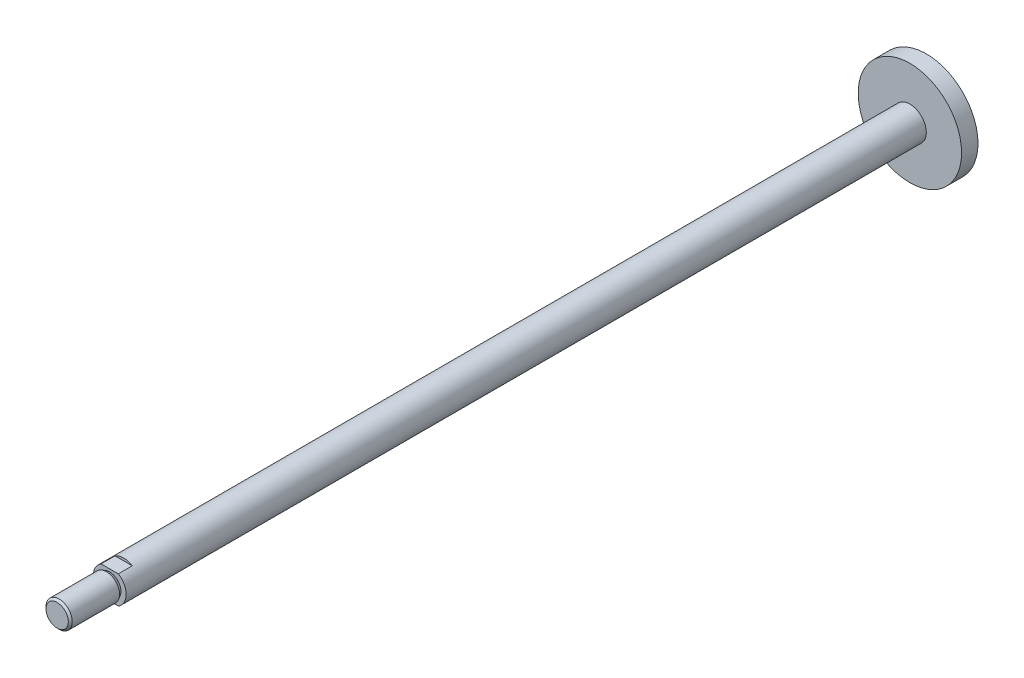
ISO-10303-21;
HEADER;
FILE_DESCRIPTION(('STEP AP214'),'2;1');
FILE_NAME('part.step','',(''),(''),'','','');
FILE_SCHEMA(('AUTOMOTIVE_DESIGN { 1 0 10303 214 1 1 1 1 }'));
ENDSEC;
DATA;
#1=APPLICATION_CONTEXT('core data for automotive mechanical design processes');
#2=APPLICATION_PROTOCOL_DEFINITION('international standard','automotive_design',2000,#1);
#3=PRODUCT_CONTEXT('',#1,'mechanical');
#4=PRODUCT('Part','Part','',(#3));
#5=PRODUCT_RELATED_PRODUCT_CATEGORY('part','',(#4));
#6=PRODUCT_DEFINITION_FORMATION('','',#4);
#7=PRODUCT_DEFINITION_CONTEXT('part definition',#1,'design');
#8=PRODUCT_DEFINITION('design','',#6,#7);
#9=PRODUCT_DEFINITION_SHAPE('','',#8);
#10=(LENGTH_UNIT() NAMED_UNIT(*) SI_UNIT(.MILLI.,.METRE.));
#11=(NAMED_UNIT(*) PLANE_ANGLE_UNIT() SI_UNIT($,.RADIAN.));
#12=(NAMED_UNIT(*) SI_UNIT($,.STERADIAN.) SOLID_ANGLE_UNIT());
#13=UNCERTAINTY_MEASURE_WITH_UNIT(LENGTH_MEASURE(1.E-05),#10,'distance_accuracy_value','');
#14=(GEOMETRIC_REPRESENTATION_CONTEXT(3) GLOBAL_UNCERTAINTY_ASSIGNED_CONTEXT((#13)) GLOBAL_UNIT_ASSIGNED_CONTEXT((#10,
#11,#12)) REPRESENTATION_CONTEXT('',''));
#15=CARTESIAN_POINT('',(0.,0.,0.));
#16=DIRECTION('',(0.,0.,1.));
#17=DIRECTION('',(1.,0.,0.));
#18=AXIS2_PLACEMENT_3D('',#15,#16,#17);
#19=CARTESIAN_POINT('',(0.,3.39999999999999,68.9999999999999));
#20=DIRECTION('',(0.,0.,1.));
#21=DIRECTION('',(1.,0.,0.));
#22=AXIS2_PLACEMENT_3D('',#19,#20,#21);
#23=PLANE('',#22);
#24=CARTESIAN_POINT('',(1.11022302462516E-13,0.,68.9999999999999));
#25=DIRECTION('',(0.,0.,-1.));
#26=DIRECTION('',(-1.,0.,0.));
#27=AXIS2_PLACEMENT_3D('',#24,#25,#26);
#28=CIRCLE('',#27,6.79999999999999);
#29=CARTESIAN_POINT('',(-6.79999999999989,0.,68.9999999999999));
#30=VERTEX_POINT('',#29);
#31=EDGE_CURVE('E20',#30,#30,#28,.T.);
#32=ORIENTED_EDGE('',*,*,#31,.F.);
#33=EDGE_LOOP('',(#32));
#34=FACE_BOUND('',#33,.T.);
#35=ADVANCED_FACE('F16',(#34),#23,.T.);
#36=CARTESIAN_POINT('',(1.11022302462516E-13,0.,67.7999999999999));
#37=DIRECTION('',(0.,0.,-1.));
#38=DIRECTION('',(-1.,0.,0.));
#39=AXIS2_PLACEMENT_3D('',#36,#37,#38);
#40=CONICAL_SURFACE('',#39,7.99999999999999,0.78539816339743);
#41=ORIENTED_EDGE('',*,*,#31,.T.);
#42=EDGE_LOOP('',(#41));
#43=FACE_BOUND('',#42,.T.);
#44=CARTESIAN_POINT('',(1.11022302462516E-13,0.,67.7999999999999));
#45=DIRECTION('',(0.,0.,1.));
#46=DIRECTION('',(1.,0.,0.));
#47=AXIS2_PLACEMENT_3D('',#44,#45,#46);
#48=CIRCLE('',#47,8.);
#49=CARTESIAN_POINT('',(8.00000000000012,0.,67.7999999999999));
#50=VERTEX_POINT('',#49);
#51=EDGE_CURVE('E108',#50,#50,#48,.F.);
#52=ORIENTED_EDGE('',*,*,#51,.F.);
#53=EDGE_LOOP('',(#52));
#54=FACE_BOUND('',#53,.T.);
#55=ADVANCED_FACE('F221',(#43,#54),#40,.T.);
#56=CARTESIAN_POINT('',(1.11022302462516E-13,0.,53.3892304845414));
#57=DIRECTION('',(0.,0.,1.));
#58=DIRECTION('',(1.,0.,0.));
#59=AXIS2_PLACEMENT_3D('',#56,#57,#58);
#60=CYLINDRICAL_SURFACE('',#59,8.);
#61=ORIENTED_EDGE('',*,*,#51,.T.);
#62=EDGE_LOOP('',(#61));
#63=FACE_BOUND('',#62,.T.);
#64=CARTESIAN_POINT('',(1.11022302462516E-13,0.,38.9784609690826));
#65=DIRECTION('',(0.,0.,1.));
#66=DIRECTION('',(0.,1.,0.));
#67=AXIS2_PLACEMENT_3D('',#64,#65,#66);
#68=CIRCLE('',#67,7.99999999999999);
#69=CARTESIAN_POINT('',(1.090629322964E-13,8.,38.9784609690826));
#70=VERTEX_POINT('',#69);
#71=EDGE_CURVE('E100',#70,#70,#68,.F.);
#72=ORIENTED_EDGE('',*,*,#71,.F.);
#73=EDGE_LOOP('',(#72));
#74=FACE_BOUND('',#73,.T.);
#75=ADVANCED_FACE('F213',(#63,#74),#60,.T.);
#76=CARTESIAN_POINT('',(0.,15.75,-460.5));
#77=DIRECTION('',(0.,0.,-1.));
#78=DIRECTION('',(-1.,0.,0.));
#79=AXIS2_PLACEMENT_3D('',#76,#77,#78);
#80=PLANE('',#79);
#81=CARTESIAN_POINT('',(0.,0.,-460.5));
#82=DIRECTION('',(0.,0.,1.));
#83=DIRECTION('',(1.,0.,0.));
#84=AXIS2_PLACEMENT_3D('',#81,#82,#83);
#85=CIRCLE('',#84,31.5);
#86=CARTESIAN_POINT('',(31.5000000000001,0.,-460.5));
#87=VERTEX_POINT('',#86);
#88=EDGE_CURVE('E97',#87,#87,#85,.T.);
#89=ORIENTED_EDGE('',*,*,#88,.F.);
#90=EDGE_LOOP('',(#89));
#91=FACE_BOUND('',#90,.T.);
#92=ADVANCED_FACE('F143',(#91),#80,.T.);
#93=CARTESIAN_POINT('',(1.11022302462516E-13,0.,38.9784609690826));
#94=DIRECTION('',(0.,0.,1.));
#95=DIRECTION('',(1.,0.,0.));
#96=AXIS2_PLACEMENT_3D('',#93,#94,#95);
#97=CONICAL_SURFACE('',#96,7.99999999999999,0.523598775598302);
#98=ORIENTED_EDGE('',*,*,#71,.T.);
#99=EDGE_LOOP('',(#98));
#100=FACE_BOUND('',#99,.T.);
#101=CARTESIAN_POINT('',(1.11022302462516E-13,0.,36.9999999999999));
#102=DIRECTION('',(0.,0.,1.));
#103=DIRECTION('',(1.,0.,0.));
#104=AXIS2_PLACEMENT_3D('',#101,#102,#103);
#105=CIRCLE('',#104,6.85773502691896);
#106=CARTESIAN_POINT('',(6.85773502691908,0.,36.9999999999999));
#107=VERTEX_POINT('',#106);
#108=EDGE_CURVE('E71',#107,#107,#105,.F.);
#109=ORIENTED_EDGE('',*,*,#108,.F.);
#110=EDGE_LOOP('',(#109));
#111=FACE_BOUND('',#110,.T.);
#112=ADVANCED_FACE('F134',(#100,#111),#97,.T.);
#113=CARTESIAN_POINT('',(0.,0.,-455.5));
#114=DIRECTION('',(0.,0.,1.));
#115=DIRECTION('',(1.,0.,0.));
#116=AXIS2_PLACEMENT_3D('',#113,#114,#115);
#117=CYLINDRICAL_SURFACE('',#116,31.5);
#118=CARTESIAN_POINT('',(0.,0.,-450.5));
#119=DIRECTION('',(0.,0.,1.));
#120=DIRECTION('',(1.,0.,0.));
#121=AXIS2_PLACEMENT_3D('',#118,#119,#120);
#122=CIRCLE('',#121,31.5);
#123=CARTESIAN_POINT('',(31.5000000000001,0.,-450.5));
#124=VERTEX_POINT('',#123);
#125=EDGE_CURVE('E81',#124,#124,#122,.T.);
#126=ORIENTED_EDGE('',*,*,#125,.F.);
#127=EDGE_LOOP('',(#126));
#128=FACE_BOUND('',#127,.T.);
#129=ORIENTED_EDGE('',*,*,#88,.T.);
#130=EDGE_LOOP('',(#129));
#131=FACE_BOUND('',#130,.T.);
#132=ADVANCED_FACE('F131',(#128,#131),#117,.T.);
#133=CARTESIAN_POINT('',(1.11022302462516E-13,0.,28.5));
#134=DIRECTION('',(0.,0.,1.));
#135=DIRECTION('',(1.,0.,0.));
#136=AXIS2_PLACEMENT_3D('',#133,#134,#135);
#137=PLANE('',#136);
#138=DIRECTION('',(1.,0.,0.));
#139=VECTOR('',#138,1.);
#140=CARTESIAN_POINT('',(-19.9999999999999,8.50000000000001,28.5));
#141=LINE('',#140,#139);
#142=CARTESIAN_POINT('',(-5.2678268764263,8.50000000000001,28.5));
#143=VERTEX_POINT('',#142);
#144=CARTESIAN_POINT('',(5.26782687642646,8.50000000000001,28.5));
#145=VERTEX_POINT('',#144);
#146=EDGE_CURVE('E77',#143,#145,#141,.T.);
#147=ORIENTED_EDGE('',*,*,#146,.T.);
#148=CARTESIAN_POINT('',(1.11022302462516E-13,0.,28.5));
#149=DIRECTION('',(0.,0.,1.));
#150=DIRECTION('',(1.,0.,0.));
#151=AXIS2_PLACEMENT_3D('',#148,#149,#150);
#152=CIRCLE('',#151,10.);
#153=EDGE_CURVE('E121',#143,#145,#152,.F.);
#154=ORIENTED_EDGE('',*,*,#153,.F.);
#155=EDGE_LOOP('',(#147,#154));
#156=FACE_BOUND('',#155,.T.);
#157=ADVANCED_FACE('F133',(#156),#137,.T.);
#158=CARTESIAN_POINT('',(-19.9999999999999,8.50000000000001,45.5000000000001));
#159=DIRECTION('',(0.,-1.,0.));
#160=DIRECTION('',(0.,0.,-1.));
#161=AXIS2_PLACEMENT_3D('',#158,#159,#160);
#162=PLANE('',#161);
#163=DIRECTION('',(1.,0.,0.));
#164=VECTOR('',#163,1.);
#165=CARTESIAN_POINT('',(1.11022302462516E-13,8.50000000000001,36.9999999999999));
#166=LINE('',#165,#164);
#167=CARTESIAN_POINT('',(5.26782687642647,8.50000000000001,36.9999999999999));
#168=VERTEX_POINT('',#167);
#169=CARTESIAN_POINT('',(-5.2678268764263,8.50000000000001,36.9999999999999));
#170=VERTEX_POINT('',#169);
#171=EDGE_CURVE('E57',#168,#170,#166,.F.);
#172=ORIENTED_EDGE('',*,*,#171,.F.);
#173=DIRECTION('',(0.,0.,1.));
#174=VECTOR('',#173,1.);
#175=CARTESIAN_POINT('',(5.26782687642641,8.50000000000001,-211.7));
#176=LINE('',#175,#174);
#177=EDGE_CURVE('E120',#145,#168,#176,.T.);
#178=ORIENTED_EDGE('',*,*,#177,.F.);
#179=ORIENTED_EDGE('',*,*,#146,.F.);
#180=DIRECTION('',(0.,0.,1.));
#181=VECTOR('',#180,1.);
#182=CARTESIAN_POINT('',(-5.26782687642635,8.50000000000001,-211.7));
#183=LINE('',#182,#181);
#184=EDGE_CURVE('E75',#170,#143,#183,.F.);
#185=ORIENTED_EDGE('',*,*,#184,.F.);
#186=EDGE_LOOP('',(#172,#178,#179,#185));
#187=FACE_BOUND('',#186,.T.);
#188=ADVANCED_FACE('F76',(#187),#162,.F.);
#189=CARTESIAN_POINT('',(0.,5.00000000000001,36.9999999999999));
#190=DIRECTION('',(0.,0.,1.));
#191=DIRECTION('',(1.,0.,0.));
#192=AXIS2_PLACEMENT_3D('',#189,#190,#191);
#193=PLANE('',#192);
#194=ORIENTED_EDGE('',*,*,#171,.T.);
#195=CARTESIAN_POINT('',(1.11022302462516E-13,0.,36.9999999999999));
#196=DIRECTION('',(0.,0.,1.));
#197=DIRECTION('',(1.,0.,0.));
#198=AXIS2_PLACEMENT_3D('',#195,#196,#197);
#199=CIRCLE('',#198,10.);
#200=CARTESIAN_POINT('',(-5.26782687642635,-8.50000000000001,36.9999999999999));
#201=VERTEX_POINT('',#200);
#202=EDGE_CURVE('E62',#201,#170,#199,.F.);
#203=ORIENTED_EDGE('',*,*,#202,.F.);
#204=DIRECTION('',(1.,0.,0.));
#205=VECTOR('',#204,1.);
#206=CARTESIAN_POINT('',(20.0000000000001,-8.50000000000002,36.9999999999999));
#207=LINE('',#206,#205);
#208=CARTESIAN_POINT('',(5.26782687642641,-8.50000000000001,36.9999999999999));
#209=VERTEX_POINT('',#208);
#210=EDGE_CURVE('E70',#201,#209,#207,.T.);
#211=ORIENTED_EDGE('',*,*,#210,.T.);
#212=CARTESIAN_POINT('',(1.11022302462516E-13,0.,36.9999999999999));
#213=DIRECTION('',(0.,0.,1.));
#214=DIRECTION('',(1.,0.,0.));
#215=AXIS2_PLACEMENT_3D('',#212,#213,#214);
#216=CIRCLE('',#215,10.);
#217=EDGE_CURVE('E65',#168,#209,#216,.F.);
#218=ORIENTED_EDGE('',*,*,#217,.F.);
#219=EDGE_LOOP('',(#194,#203,#211,#218));
#220=FACE_BOUND('',#219,.T.);
#221=ORIENTED_EDGE('',*,*,#108,.T.);
#222=EDGE_LOOP('',(#221));
#223=FACE_BOUND('',#222,.T.);
#224=ADVANCED_FACE('F59',(#220,#223),#193,.T.);
#225=CARTESIAN_POINT('',(20.0000000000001,-8.50000000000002,45.5000000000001));
#226=DIRECTION('',(0.,1.,0.));
#227=DIRECTION('',(0.,0.,1.));
#228=AXIS2_PLACEMENT_3D('',#225,#226,#227);
#229=PLANE('',#228);
#230=DIRECTION('',(1.,0.,0.));
#231=VECTOR('',#230,1.);
#232=CARTESIAN_POINT('',(0.,-8.50000000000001,28.5));
#233=LINE('',#232,#231);
#234=CARTESIAN_POINT('',(5.26782687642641,-8.50000000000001,28.5));
#235=VERTEX_POINT('',#234);
#236=CARTESIAN_POINT('',(-5.26782687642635,-8.50000000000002,28.5));
#237=VERTEX_POINT('',#236);
#238=EDGE_CURVE('E36',#235,#237,#233,.F.);
#239=ORIENTED_EDGE('',*,*,#238,.F.);
#240=DIRECTION('',(0.,0.,1.));
#241=VECTOR('',#240,1.);
#242=CARTESIAN_POINT('',(5.26782687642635,-8.50000000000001,-211.7));
#243=LINE('',#242,#241);
#244=EDGE_CURVE('E118',#209,#235,#243,.F.);
#245=ORIENTED_EDGE('',*,*,#244,.F.);
#246=ORIENTED_EDGE('',*,*,#210,.F.);
#247=DIRECTION('',(0.,0.,1.));
#248=VECTOR('',#247,1.);
#249=CARTESIAN_POINT('',(-5.26782687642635,-8.50000000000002,-211.7));
#250=LINE('',#249,#248);
#251=EDGE_CURVE('E85',#237,#201,#250,.T.);
#252=ORIENTED_EDGE('',*,*,#251,.F.);
#253=EDGE_LOOP('',(#239,#245,#246,#252));
#254=FACE_BOUND('',#253,.T.);
#255=ADVANCED_FACE('F153',(#254),#229,.F.);
#256=CARTESIAN_POINT('',(1.11022302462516E-13,0.,28.5));
#257=DIRECTION('',(0.,0.,1.));
#258=DIRECTION('',(1.,0.,0.));
#259=AXIS2_PLACEMENT_3D('',#256,#257,#258);
#260=PLANE('',#259);
#261=ORIENTED_EDGE('',*,*,#238,.T.);
#262=CARTESIAN_POINT('',(1.11022302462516E-13,0.,28.5));
#263=DIRECTION('',(0.,0.,1.));
#264=DIRECTION('',(1.,0.,0.));
#265=AXIS2_PLACEMENT_3D('',#262,#263,#264);
#266=CIRCLE('',#265,10.);
#267=EDGE_CURVE('E27',#235,#237,#266,.F.);
#268=ORIENTED_EDGE('',*,*,#267,.F.);
#269=EDGE_LOOP('',(#261,#268));
#270=FACE_BOUND('',#269,.T.);
#271=ADVANCED_FACE('F149',(#270),#260,.T.);
#272=CARTESIAN_POINT('',(0.,15.75,-450.5));
#273=DIRECTION('',(0.,0.,1.));
#274=DIRECTION('',(1.,0.,0.));
#275=AXIS2_PLACEMENT_3D('',#272,#273,#274);
#276=PLANE('',#275);
#277=ORIENTED_EDGE('',*,*,#125,.T.);
#278=EDGE_LOOP('',(#277));
#279=FACE_BOUND('',#278,.T.);
#280=CARTESIAN_POINT('',(0.,0.,-450.5));
#281=DIRECTION('',(0.,0.,1.));
#282=DIRECTION('',(1.,0.,0.));
#283=AXIS2_PLACEMENT_3D('',#280,#281,#282);
#284=CIRCLE('',#283,10.);
#285=CARTESIAN_POINT('',(10.,0.,-450.5));
#286=VERTEX_POINT('',#285);
#287=EDGE_CURVE('E11',#286,#286,#284,.T.);
#288=ORIENTED_EDGE('',*,*,#287,.F.);
#289=EDGE_LOOP('',(#288));
#290=FACE_BOUND('',#289,.T.);
#291=ADVANCED_FACE('F128',(#279,#290),#276,.T.);
#292=CARTESIAN_POINT('',(1.11022302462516E-13,0.,-211.7));
#293=DIRECTION('',(0.,0.,1.));
#294=DIRECTION('',(1.,0.,0.));
#295=AXIS2_PLACEMENT_3D('',#292,#293,#294);
#296=CYLINDRICAL_SURFACE('',#295,10.);
#297=ORIENTED_EDGE('',*,*,#184,.T.);
#298=ORIENTED_EDGE('',*,*,#153,.T.);
#299=ORIENTED_EDGE('',*,*,#177,.T.);
#300=ORIENTED_EDGE('',*,*,#217,.T.);
#301=ORIENTED_EDGE('',*,*,#244,.T.);
#302=ORIENTED_EDGE('',*,*,#267,.T.);
#303=ORIENTED_EDGE('',*,*,#251,.T.);
#304=ORIENTED_EDGE('',*,*,#202,.T.);
#305=EDGE_LOOP('',(#297,#298,#299,#300,#301,#302,#303,#304));
#306=FACE_BOUND('',#305,.T.);
#307=ORIENTED_EDGE('',*,*,#287,.T.);
#308=EDGE_LOOP('',(#307));
#309=FACE_BOUND('',#308,.T.);
#310=ADVANCED_FACE('F18',(#306,#309),#296,.T.);
#311=CLOSED_SHELL('',(#35,#55,#75,#92,#112,#132,#157,#188,#224,#255,#271,#291,#310));
#312=MANIFOLD_SOLID_BREP('B1',#311);
#313=ADVANCED_BREP_SHAPE_REPRESENTATION('',(#18,#312),#14);
#314=SHAPE_DEFINITION_REPRESENTATION(#9,#313);
ENDSEC;
END-ISO-10303-21;
